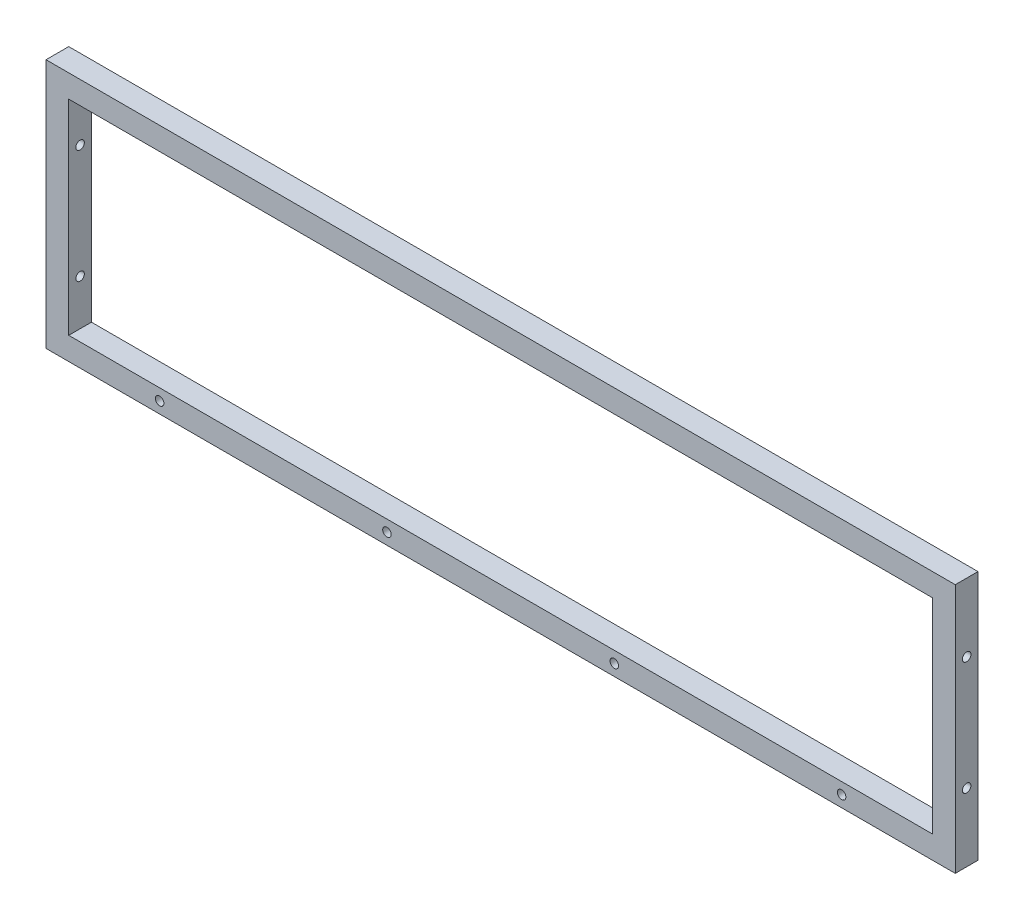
from build123d import *

# Parameters (mm, degrees)
SKETCH1_W                    = 1016
SKETCH1_H                    = 279.4
SKETCH1_W_2                  = 965.2
SKETCH1_H_2                  = 228.6
BOSS_EXTRUDE1_DEPTH          = 25.4
F_3_8_0_375_DIAMETER_HOLE5_D = 9.525
SKETCH14_R                   = 4.7625
CUT_EXTRUDE1_DEPTH           = 1026.873895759


with BuildPart() as part:
    # Sketch1 → Boss-Extrude1 (new body)
    with BuildSketch(Plane.XY):
        Rectangle(SKETCH1_W, SKETCH1_H)
        Rectangle(SKETCH1_W_2, SKETCH1_H_2, mode=Mode.SUBTRACT)
    extrude(amount=BOSS_EXTRUDE1_DEPTH)

    # 3_8 _0.375_ Diameter Hole5 (through all)
    with Locations(Plane.XY.offset(25.4)):
        with Locations((-381, -127), (-127, -127)):
            f_3_8_0_375_diameter_hole5 = Hole(F_3_8_0_375_DIAMETER_HOLE5_D / 2)

    # Mirror3: 3_8 _0.375_ Diameter Hole5 across plane
    add(f_3_8_0_375_diameter_hole5.mirror(Plane(origin=(0, 0, 0), x_dir=(0, 0, 1), z_dir=(1, 0, 0))), mode=Mode.SUBTRACT)

    # Sketch14 → Cut-Extrude1 (cut, through all)
    with BuildSketch(Plane(origin=(508, 0, 0), x_dir=(0, 0, -1), z_dir=(1, 0, 0))):
        with Locations((-12.7, 63.5)):
            Circle(SKETCH14_R)
        with Locations(Location((-12.7, -63.5, 0), (0, 0, 180))):
            Circle(SKETCH14_R)
    extrude(amount=-CUT_EXTRUDE1_DEPTH, mode=Mode.SUBTRACT)


solid = part.part
